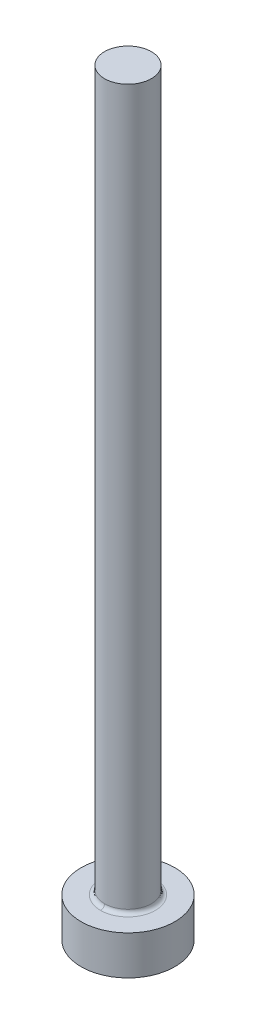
ISO-10303-21;
HEADER;
FILE_DESCRIPTION(('STEP AP214'),'2;1');
FILE_NAME('part.step','',(''),(''),'','','');
FILE_SCHEMA(('AUTOMOTIVE_DESIGN { 1 0 10303 214 1 1 1 1 }'));
ENDSEC;
DATA;
#1=APPLICATION_CONTEXT('core data for automotive mechanical design processes');
#2=APPLICATION_PROTOCOL_DEFINITION('international standard','automotive_design',2000,#1);
#3=PRODUCT_CONTEXT('',#1,'mechanical');
#4=PRODUCT('Part','Part','',(#3));
#5=PRODUCT_RELATED_PRODUCT_CATEGORY('part','',(#4));
#6=PRODUCT_DEFINITION_FORMATION('','',#4);
#7=PRODUCT_DEFINITION_CONTEXT('part definition',#1,'design');
#8=PRODUCT_DEFINITION('design','',#6,#7);
#9=PRODUCT_DEFINITION_SHAPE('','',#8);
#10=(LENGTH_UNIT() NAMED_UNIT(*) SI_UNIT(.MILLI.,.METRE.));
#11=(NAMED_UNIT(*) PLANE_ANGLE_UNIT() SI_UNIT($,.RADIAN.));
#12=(NAMED_UNIT(*) SI_UNIT($,.STERADIAN.) SOLID_ANGLE_UNIT());
#13=UNCERTAINTY_MEASURE_WITH_UNIT(LENGTH_MEASURE(1.E-05),#10,'distance_accuracy_value','');
#14=(GEOMETRIC_REPRESENTATION_CONTEXT(3) GLOBAL_UNCERTAINTY_ASSIGNED_CONTEXT((#13)) GLOBAL_UNIT_ASSIGNED_CONTEXT((#10,
#11,#12)) REPRESENTATION_CONTEXT('',''));
#15=CARTESIAN_POINT('',(0.,0.,0.));
#16=DIRECTION('',(0.,0.,1.));
#17=DIRECTION('',(1.,0.,0.));
#18=AXIS2_PLACEMENT_3D('',#15,#16,#17);
#19=CARTESIAN_POINT('',(-6.07200000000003,-106.,71.0720000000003));
#20=DIRECTION('',(0.,-1.,0.));
#21=DIRECTION('',(0.,0.,-1.));
#22=AXIS2_PLACEMENT_3D('',#19,#20,#21);
#23=PLANE('',#22);
#24=CARTESIAN_POINT('',(0.,-106.,65.0000000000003));
#25=DIRECTION('',(0.,1.,0.));
#26=DIRECTION('',(-1.,0.,0.));
#27=AXIS2_PLACEMENT_3D('',#24,#25,#26);
#28=CIRCLE('',#27,6.00000000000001);
#29=CARTESIAN_POINT('',(-6.00000000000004,-106.,65.0000000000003));
#30=VERTEX_POINT('',#29);
#31=EDGE_CURVE('E29',#30,#30,#28,.F.);
#32=ORIENTED_EDGE('',*,*,#31,.T.);
#33=EDGE_LOOP('',(#32));
#34=FACE_BOUND('',#33,.T.);
#35=ADVANCED_FACE('F24',(#34),#23,.T.);
#36=CARTESIAN_POINT('',(0.,-106.,65.0000000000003));
#37=DIRECTION('',(0.,1.,0.));
#38=DIRECTION('',(-1.,0.,0.));
#39=AXIS2_PLACEMENT_3D('',#36,#37,#38);
#40=CYLINDRICAL_SURFACE('',#39,6.00000000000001);
#41=CARTESIAN_POINT('',(0.,-101.,65.0000000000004));
#42=DIRECTION('',(0.,1.,0.));
#43=DIRECTION('',(-1.,0.,0.));
#44=AXIS2_PLACEMENT_3D('',#41,#42,#43);
#45=CIRCLE('',#44,6.00000000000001);
#46=CARTESIAN_POINT('',(-6.00000000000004,-101.,65.0000000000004));
#47=VERTEX_POINT('',#46);
#48=EDGE_CURVE('E66',#47,#47,#45,.T.);
#49=ORIENTED_EDGE('',*,*,#48,.F.);
#50=EDGE_LOOP('',(#49));
#51=FACE_BOUND('',#50,.T.);
#52=ORIENTED_EDGE('',*,*,#31,.F.);
#53=EDGE_LOOP('',(#52));
#54=FACE_BOUND('',#53,.T.);
#55=ADVANCED_FACE('F101',(#51,#54),#40,.T.);
#56=CARTESIAN_POINT('',(0.,-100.997502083,68.5499167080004));
#57=CARTESIAN_POINT('',(7.09983341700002,-100.997502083,68.5499167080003));
#58=CARTESIAN_POINT('',(7.09983341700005,-100.997502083,61.4500832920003));
#59=CARTESIAN_POINT('',(0.,-100.997502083,61.4500832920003));
#60=CARTESIAN_POINT('',(0.,-101.031610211,68.2099731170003));
#61=CARTESIAN_POINT('',(6.419946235,-101.031610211,68.2099731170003));
#62=CARTESIAN_POINT('',(6.419946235,-101.031610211,61.7900268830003));
#63=CARTESIAN_POINT('',(0.,-101.031610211,61.7900268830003));
#64=CARTESIAN_POINT('',(0.,-100.790026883,67.9683897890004));
#65=CARTESIAN_POINT('',(5.93677957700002,-100.790026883,67.9683897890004));
#66=CARTESIAN_POINT('',(5.93677957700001,-100.790026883,62.0316102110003));
#67=CARTESIAN_POINT('',(0.,-100.790026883,62.0316102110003));
#68=CARTESIAN_POINT('',(0.,-100.450083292,68.0024979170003));
#69=CARTESIAN_POINT('',(6.00499583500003,-100.450083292,68.0024979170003));
#70=CARTESIAN_POINT('',(6.00499583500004,-100.450083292,61.9975020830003));
#71=CARTESIAN_POINT('',(0.,-100.450083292,61.9975020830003));
#72=(BOUNDED_SURFACE() B_SPLINE_SURFACE(3,3,((#56,#57,#58,#59),(#60,#61,#62,#63),(#64,#65,#66,
#67),(#68,#69,#70,#71)),.UNSPECIFIED.,.F.,.F.,.F.) B_SPLINE_SURFACE_WITH_KNOTS((4,4),(4,4),(0.,
1.),(0.,1.),.UNSPECIFIED.) GEOMETRIC_REPRESENTATION_ITEM() RATIONAL_B_SPLINE_SURFACE(((1.,
0.333333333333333,0.333333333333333,1.),(0.755320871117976,0.251773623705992,0.251773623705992,
0.755320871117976),(0.755320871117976,0.251773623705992,0.251773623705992,0.755320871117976),
(1.,0.333333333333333,0.333333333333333,1.))) REPRESENTATION_ITEM('') SURFACE());
#73=CARTESIAN_POINT('',(0.,-100.5,65.0000000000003));
#74=DIRECTION('',(0.,1.,0.));
#75=DIRECTION('',(0.,0.,1.));
#76=AXIS2_PLACEMENT_3D('',#73,#74,#75);
#77=CIRCLE('',#76,3.);
#78=CARTESIAN_POINT('',(-6.15318343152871E-10,-100.500000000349,62.0000000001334));
#79=VERTEX_POINT('',#78);
#80=CARTESIAN_POINT('',(-1.68367923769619E-10,-100.500000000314,67.9999999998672));
#81=VERTEX_POINT('',#80);
#82=EDGE_CURVE('E59',#79,#81,#77,.F.);
#83=CARTESIAN_POINT('',(0.,-100.997502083,68.5499167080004));
#84=CARTESIAN_POINT('',(0.,-101.031610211,68.2099731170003));
#85=CARTESIAN_POINT('',(0.,-100.790026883,67.9683897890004));
#86=CARTESIAN_POINT('',(0.,-100.450083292,68.0024979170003));
#87=(BOUNDED_CURVE() B_SPLINE_CURVE(3,(#83,#84,#85,#86),.UNSPECIFIED.,.F.,
.F.) B_SPLINE_CURVE_WITH_KNOTS((4,4),(0.,1.),
.UNSPECIFIED.) CURVE() GEOMETRIC_REPRESENTATION_ITEM() RATIONAL_B_SPLINE_CURVE((1.,
0.755320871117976,0.755320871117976,1.)) REPRESENTATION_ITEM(''));
#88=CARTESIAN_POINT('',(0.,-101.00000000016,68.5000000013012));
#89=VERTEX_POINT('',#88);
#90=EDGE_CURVE('E53',#89,#81,#87,.T.);
#91=CARTESIAN_POINT('',(0.,-101.000000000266,68.4999999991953));
#92=CARTESIAN_POINT('',(6.99999999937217,-101.000000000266,68.4999999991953));
#93=CARTESIAN_POINT('',(6.99999999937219,-101.000000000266,61.5000000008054));
#94=CARTESIAN_POINT('',(0.,-101.000000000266,61.5000000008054));
#95=(BOUNDED_CURVE() B_SPLINE_CURVE(3,(#91,#92,#93,#94),.UNSPECIFIED.,.F.,
.F.) B_SPLINE_CURVE_WITH_KNOTS((4,4),(0.,1.),
.UNSPECIFIED.) CURVE() GEOMETRIC_REPRESENTATION_ITEM() RATIONAL_B_SPLINE_CURVE((0.956578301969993,
0.318859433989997,0.318859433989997,0.956578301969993)) REPRESENTATION_ITEM(''));
#96=CARTESIAN_POINT('',(0.,-101.00000000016,61.4999999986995));
#97=VERTEX_POINT('',#96);
#98=EDGE_CURVE('E56',#97,#89,#95,.F.);
#99=CARTESIAN_POINT('',(0.,-100.997502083,61.4500832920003));
#100=CARTESIAN_POINT('',(0.,-101.031610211,61.7900268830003));
#101=CARTESIAN_POINT('',(0.,-100.790026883,62.0316102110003));
#102=CARTESIAN_POINT('',(0.,-100.450083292,61.9975020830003));
#103=(BOUNDED_CURVE() B_SPLINE_CURVE(3,(#99,#100,#101,#102),.UNSPECIFIED.,.F.,
.F.) B_SPLINE_CURVE_WITH_KNOTS((4,4),(0.,1.),
.UNSPECIFIED.) CURVE() GEOMETRIC_REPRESENTATION_ITEM() RATIONAL_B_SPLINE_CURVE((1.,
0.755320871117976,0.755320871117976,1.)) REPRESENTATION_ITEM(''));
#104=EDGE_CURVE('E44',#79,#97,#103,.F.);
#105=ORIENTED_EDGE('',*,*,#82,.T.);
#106=ORIENTED_EDGE('',*,*,#90,.F.);
#107=ORIENTED_EDGE('',*,*,#98,.F.);
#108=ORIENTED_EDGE('',*,*,#104,.F.);
#109=EDGE_LOOP('',(#105,#106,#107,#108));
#110=FACE_BOUND('',#109,.T.);
#111=ADVANCED_FACE('F55',(#110),#72,.F.);
#112=CARTESIAN_POINT('',(-3.03600000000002,-9.,61.9640000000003));
#113=DIRECTION('',(0.,1.,0.));
#114=DIRECTION('',(0.,0.,1.));
#115=AXIS2_PLACEMENT_3D('',#112,#113,#114);
#116=PLANE('',#115);
#117=CARTESIAN_POINT('',(0.,-9.00000000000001,65.0000000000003));
#118=DIRECTION('',(0.,1.,0.));
#119=DIRECTION('',(0.,0.,1.));
#120=AXIS2_PLACEMENT_3D('',#117,#118,#119);
#121=CIRCLE('',#120,3.);
#122=CARTESIAN_POINT('',(0.,-9.00000000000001,68.0000000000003));
#123=VERTEX_POINT('',#122);
#124=EDGE_CURVE('E65',#123,#123,#121,.T.);
#125=ORIENTED_EDGE('',*,*,#124,.T.);
#126=EDGE_LOOP('',(#125));
#127=FACE_BOUND('',#126,.T.);
#128=ADVANCED_FACE('F100',(#127),#116,.T.);
#129=CARTESIAN_POINT('',(-6.07200000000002,-101.,58.9280000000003));
#130=DIRECTION('',(0.,1.,0.));
#131=DIRECTION('',(0.,0.,1.));
#132=AXIS2_PLACEMENT_3D('',#129,#130,#131);
#133=PLANE('',#132);
#134=CARTESIAN_POINT('',(0.,-101.000000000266,61.5000000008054));
#135=CARTESIAN_POINT('',(-6.99999999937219,-101.000000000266,61.5000000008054));
#136=CARTESIAN_POINT('',(-6.9999999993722,-101.000000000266,68.4999999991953));
#137=CARTESIAN_POINT('',(0.,-101.000000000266,68.4999999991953));
#138=(BOUNDED_CURVE() B_SPLINE_CURVE(3,(#134,#135,#136,#137),.UNSPECIFIED.,.F.,
.F.) B_SPLINE_CURVE_WITH_KNOTS((4,4),(0.,1.),
.UNSPECIFIED.) CURVE() GEOMETRIC_REPRESENTATION_ITEM() RATIONAL_B_SPLINE_CURVE((0.956578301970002,
0.318859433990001,0.318859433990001,0.956578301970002)) REPRESENTATION_ITEM(''));
#139=EDGE_CURVE('E35',#89,#97,#138,.F.);
#140=ORIENTED_EDGE('',*,*,#139,.T.);
#141=ORIENTED_EDGE('',*,*,#98,.T.);
#142=EDGE_LOOP('',(#140,#141));
#143=FACE_BOUND('',#142,.T.);
#144=ORIENTED_EDGE('',*,*,#48,.T.);
#145=EDGE_LOOP('',(#144));
#146=FACE_BOUND('',#145,.T.);
#147=ADVANCED_FACE('F26',(#143,#146),#133,.T.);
#148=CARTESIAN_POINT('',(0.,-100.5,65.0000000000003));
#149=DIRECTION('',(0.,1.,0.));
#150=DIRECTION('',(0.,0.,1.));
#151=AXIS2_PLACEMENT_3D('',#148,#149,#150);
#152=CYLINDRICAL_SURFACE('',#151,3.);
#153=CARTESIAN_POINT('',(0.,-100.500000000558,65.0000000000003));
#154=DIRECTION('',(0.,1.,0.));
#155=DIRECTION('',(0.,0.,1.));
#156=AXIS2_PLACEMENT_3D('',#153,#154,#155);
#157=CIRCLE('',#156,2.9999999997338);
#158=EDGE_CURVE('E13',#79,#81,#157,.T.);
#159=ORIENTED_EDGE('',*,*,#158,.T.);
#160=ORIENTED_EDGE('',*,*,#82,.F.);
#161=EDGE_LOOP('',(#159,#160));
#162=FACE_BOUND('',#161,.T.);
#163=ORIENTED_EDGE('',*,*,#124,.F.);
#164=EDGE_LOOP('',(#163));
#165=FACE_BOUND('',#164,.T.);
#166=ADVANCED_FACE('F86',(#162,#165),#152,.T.);
#167=CARTESIAN_POINT('',(0.,-100.997502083,61.4500832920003));
#168=CARTESIAN_POINT('',(-7.09983341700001,-100.997502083,61.4500832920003));
#169=CARTESIAN_POINT('',(-7.09983341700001,-100.997502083,68.5499167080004));
#170=CARTESIAN_POINT('',(0.,-100.997502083,68.5499167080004));
#171=CARTESIAN_POINT('',(0.,-101.031610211,61.7900268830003));
#172=CARTESIAN_POINT('',(-6.41994623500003,-101.031610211,61.7900268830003));
#173=CARTESIAN_POINT('',(-6.41994623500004,-101.031610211,68.2099731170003));
#174=CARTESIAN_POINT('',(0.,-101.031610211,68.2099731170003));
#175=CARTESIAN_POINT('',(0.,-100.790026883,62.0316102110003));
#176=CARTESIAN_POINT('',(-5.93677957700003,-100.790026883,62.0316102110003));
#177=CARTESIAN_POINT('',(-5.93677957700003,-100.790026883,67.9683897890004));
#178=CARTESIAN_POINT('',(0.,-100.790026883,67.9683897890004));
#179=CARTESIAN_POINT('',(0.,-100.450083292,61.9975020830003));
#180=CARTESIAN_POINT('',(-6.00499583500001,-100.450083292,61.9975020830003));
#181=CARTESIAN_POINT('',(-6.00499583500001,-100.450083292,68.0024979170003));
#182=CARTESIAN_POINT('',(0.,-100.450083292,68.0024979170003));
#183=(BOUNDED_SURFACE() B_SPLINE_SURFACE(3,3,((#167,#168,#169,#170),(#171,#172,#173,#174),(#175,
#176,#177,#178),(#179,#180,#181,#182)),.UNSPECIFIED.,.F.,.F.,
.F.) B_SPLINE_SURFACE_WITH_KNOTS((4,4),(4,4),(0.,1.),(0.,1.),
.UNSPECIFIED.) GEOMETRIC_REPRESENTATION_ITEM() RATIONAL_B_SPLINE_SURFACE(((1.,0.333333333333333,
0.333333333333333,1.),(0.755320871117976,0.251773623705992,0.251773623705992,0.755320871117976),
(0.755320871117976,0.251773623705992,0.251773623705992,0.755320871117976),(1.,0.333333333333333,
0.333333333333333,1.))) REPRESENTATION_ITEM('') SURFACE());
#184=ORIENTED_EDGE('',*,*,#104,.T.);
#185=ORIENTED_EDGE('',*,*,#139,.F.);
#186=ORIENTED_EDGE('',*,*,#90,.T.);
#187=ORIENTED_EDGE('',*,*,#158,.F.);
#188=EDGE_LOOP('',(#184,#185,#186,#187));
#189=FACE_BOUND('',#188,.T.);
#190=ADVANCED_FACE('F70',(#189),#183,.F.);
#191=CLOSED_SHELL('',(#35,#55,#111,#128,#147,#166,#190));
#192=MANIFOLD_SOLID_BREP('B1',#191);
#193=ADVANCED_BREP_SHAPE_REPRESENTATION('',(#18,#192),#14);
#194=SHAPE_DEFINITION_REPRESENTATION(#9,#193);
ENDSEC;
END-ISO-10303-21;
